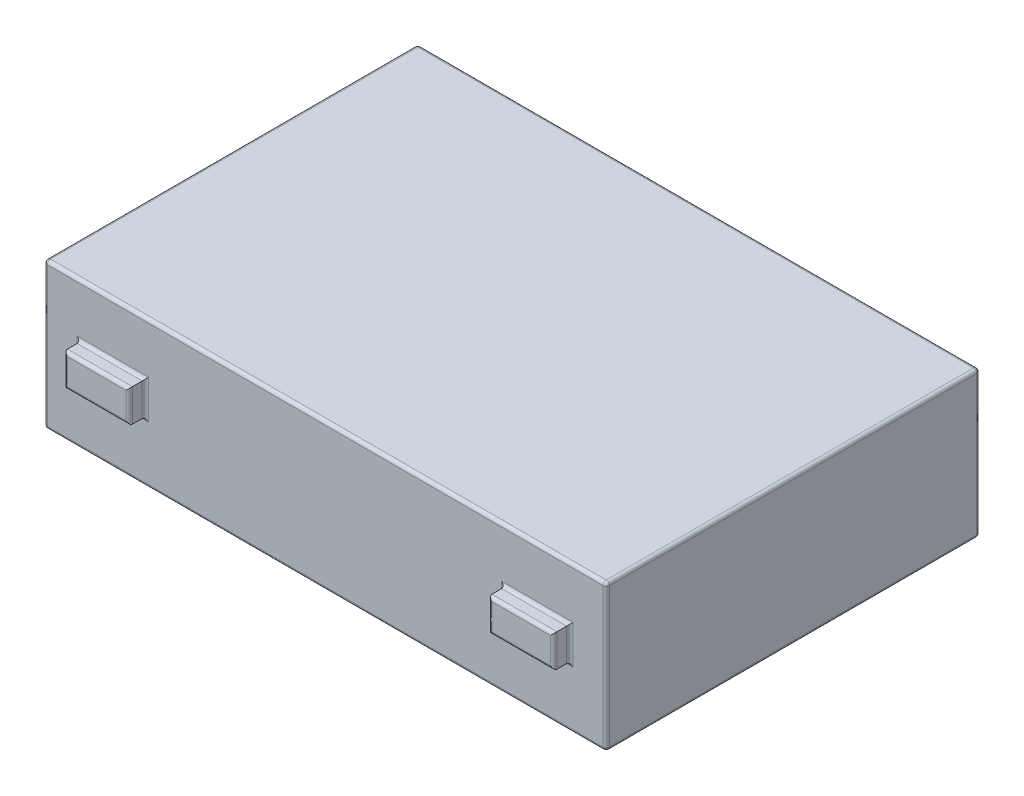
ISO-10303-21;
HEADER;
FILE_DESCRIPTION(('STEP AP214'),'2;1');
FILE_NAME('part.step','',(''),(''),'','','');
FILE_SCHEMA(('AUTOMOTIVE_DESIGN { 1 0 10303 214 1 1 1 1 }'));
ENDSEC;
DATA;
#1=APPLICATION_CONTEXT('core data for automotive mechanical design processes');
#2=APPLICATION_PROTOCOL_DEFINITION('international standard','automotive_design',2000,#1);
#3=PRODUCT_CONTEXT('',#1,'mechanical');
#4=PRODUCT('Part','Part','',(#3));
#5=PRODUCT_RELATED_PRODUCT_CATEGORY('part','',(#4));
#6=PRODUCT_DEFINITION_FORMATION('','',#4);
#7=PRODUCT_DEFINITION_CONTEXT('part definition',#1,'design');
#8=PRODUCT_DEFINITION('design','',#6,#7);
#9=PRODUCT_DEFINITION_SHAPE('','',#8);
#10=(LENGTH_UNIT() NAMED_UNIT(*) SI_UNIT(.MILLI.,.METRE.));
#11=(NAMED_UNIT(*) PLANE_ANGLE_UNIT() SI_UNIT($,.RADIAN.));
#12=(NAMED_UNIT(*) SI_UNIT($,.STERADIAN.) SOLID_ANGLE_UNIT());
#13=UNCERTAINTY_MEASURE_WITH_UNIT(LENGTH_MEASURE(1.E-05),#10,'distance_accuracy_value','');
#14=(GEOMETRIC_REPRESENTATION_CONTEXT(3) GLOBAL_UNCERTAINTY_ASSIGNED_CONTEXT((#13)) GLOBAL_UNIT_ASSIGNED_CONTEXT((#10,
#11,#12)) REPRESENTATION_CONTEXT('',''));
#15=CARTESIAN_POINT('',(0.,0.,0.));
#16=DIRECTION('',(0.,0.,1.));
#17=DIRECTION('',(1.,0.,0.));
#18=AXIS2_PLACEMENT_3D('',#15,#16,#17);
#19=CARTESIAN_POINT('',(0.,0.,115.));
#20=DIRECTION('',(0.,0.,1.));
#21=DIRECTION('',(1.,0.,0.));
#22=AXIS2_PLACEMENT_3D('',#19,#20,#21);
#23=PLANE('',#22);
#24=DIRECTION('',(1.,0.,0.));
#25=VECTOR('',#24,1.);
#26=CARTESIAN_POINT('',(0.,-4.88222245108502,115.));
#27=LINE('',#26,#25);
#28=CARTESIAN_POINT('',(76.318867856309,-4.88222245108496,115.));
#29=VERTEX_POINT('',#28);
#30=CARTESIAN_POINT('',(54.318867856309,-4.88222245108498,115.));
#31=VERTEX_POINT('',#30);
#32=EDGE_CURVE('E403',#29,#31,#27,.F.);
#33=ORIENTED_EDGE('',*,*,#32,.T.);
#34=DIRECTION('',(0.,-1.,0.));
#35=VECTOR('',#34,1.);
#36=CARTESIAN_POINT('',(54.318867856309,0.,115.));
#37=LINE('',#36,#35);
#38=CARTESIAN_POINT('',(54.318867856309,7.11777754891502,115.));
#39=VERTEX_POINT('',#38);
#40=EDGE_CURVE('E406',#31,#39,#37,.F.);
#41=ORIENTED_EDGE('',*,*,#40,.T.);
#42=DIRECTION('',(-1.,0.,0.));
#43=VECTOR('',#42,1.);
#44=CARTESIAN_POINT('',(0.,7.11777754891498,115.));
#45=LINE('',#44,#43);
#46=CARTESIAN_POINT('',(76.318867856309,7.11777754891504,115.));
#47=VERTEX_POINT('',#46);
#48=EDGE_CURVE('E397',#39,#47,#45,.F.);
#49=ORIENTED_EDGE('',*,*,#48,.T.);
#50=DIRECTION('',(0.,1.,0.));
#51=VECTOR('',#50,1.);
#52=CARTESIAN_POINT('',(76.318867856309,2.11827410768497E-13,115.));
#53=LINE('',#52,#51);
#54=EDGE_CURVE('E400',#47,#29,#53,.F.);
#55=ORIENTED_EDGE('',*,*,#54,.T.);
#56=EDGE_LOOP('',(#33,#41,#49,#55));
#57=FACE_BOUND('',#56,.T.);
#58=DIRECTION('',(-1.,0.,0.));
#59=VECTOR('',#58,1.);
#60=CARTESIAN_POINT('',(0.,7.11777754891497,115.));
#61=LINE('',#60,#59);
#62=CARTESIAN_POINT('',(-76.318867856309,7.11777754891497,115.));
#63=VERTEX_POINT('',#62);
#64=CARTESIAN_POINT('',(-54.318867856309,7.11777754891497,115.));
#65=VERTEX_POINT('',#64);
#66=EDGE_CURVE('E390',#63,#65,#61,.F.);
#67=ORIENTED_EDGE('',*,*,#66,.T.);
#68=DIRECTION('',(0.,1.,0.));
#69=VECTOR('',#68,1.);
#70=CARTESIAN_POINT('',(-54.318867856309,0.,115.));
#71=LINE('',#70,#69);
#72=CARTESIAN_POINT('',(-54.318867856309,-4.88222245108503,115.));
#73=VERTEX_POINT('',#72);
#74=EDGE_CURVE('E393',#65,#73,#71,.F.);
#75=ORIENTED_EDGE('',*,*,#74,.T.);
#76=DIRECTION('',(1.,0.,0.));
#77=VECTOR('',#76,1.);
#78=CARTESIAN_POINT('',(0.,-4.88222245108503,115.));
#79=LINE('',#78,#77);
#80=CARTESIAN_POINT('',(-76.318867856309,-4.88222245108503,115.));
#81=VERTEX_POINT('',#80);
#82=EDGE_CURVE('E384',#73,#81,#79,.F.);
#83=ORIENTED_EDGE('',*,*,#82,.T.);
#84=DIRECTION('',(0.,-1.,0.));
#85=VECTOR('',#84,1.);
#86=CARTESIAN_POINT('',(-76.318867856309,0.,115.));
#87=LINE('',#86,#85);
#88=EDGE_CURVE('E387',#81,#63,#87,.F.);
#89=ORIENTED_EDGE('',*,*,#88,.T.);
#90=EDGE_LOOP('',(#67,#75,#83,#89));
#91=FACE_BOUND('',#90,.T.);
#92=DIRECTION('',(0.,-1.,0.));
#93=VECTOR('',#92,1.);
#94=CARTESIAN_POINT('',(-85.5,-22.5,115.));
#95=LINE('',#94,#93);
#96=CARTESIAN_POINT('',(-85.5,21.5,115.));
#97=VERTEX_POINT('',#96);
#98=CARTESIAN_POINT('',(-85.5,-21.5,115.));
#99=VERTEX_POINT('',#98);
#100=EDGE_CURVE('E377',#97,#99,#95,.T.);
#101=ORIENTED_EDGE('',*,*,#100,.T.);
#102=DIRECTION('',(1.,0.,0.));
#103=VECTOR('',#102,1.);
#104=CARTESIAN_POINT('',(86.5,-21.5,115.));
#105=LINE('',#104,#103);
#106=CARTESIAN_POINT('',(85.5,-21.5,115.));
#107=VERTEX_POINT('',#106);
#108=EDGE_CURVE('E380',#99,#107,#105,.T.);
#109=ORIENTED_EDGE('',*,*,#108,.T.);
#110=DIRECTION('',(0.,1.,0.));
#111=VECTOR('',#110,1.);
#112=CARTESIAN_POINT('',(85.5,22.5,115.));
#113=LINE('',#112,#111);
#114=CARTESIAN_POINT('',(85.5,21.5,115.));
#115=VERTEX_POINT('',#114);
#116=EDGE_CURVE('E371',#107,#115,#113,.T.);
#117=ORIENTED_EDGE('',*,*,#116,.T.);
#118=DIRECTION('',(-1.,0.,0.));
#119=VECTOR('',#118,1.);
#120=CARTESIAN_POINT('',(-86.5,21.5,115.));
#121=LINE('',#120,#119);
#122=EDGE_CURVE('E374',#115,#97,#121,.T.);
#123=ORIENTED_EDGE('',*,*,#122,.T.);
#124=EDGE_LOOP('',(#101,#109,#117,#123));
#125=FACE_BOUND('',#124,.T.);
#126=ADVANCED_FACE('F49',(#57,#91,#125),#23,.T.);
#127=CARTESIAN_POINT('',(86.5,-22.5,115.));
#128=DIRECTION('',(-1.,0.,0.));
#129=DIRECTION('',(0.,-1.,0.));
#130=AXIS2_PLACEMENT_3D('',#127,#128,#129);
#131=PLANE('',#130);
#132=DIRECTION('',(0.,1.,0.));
#133=VECTOR('',#132,1.);
#134=CARTESIAN_POINT('',(86.5,-22.5,114.));
#135=LINE('',#134,#133);
#136=CARTESIAN_POINT('',(86.5,21.5,114.));
#137=VERTEX_POINT('',#136);
#138=CARTESIAN_POINT('',(86.5,-21.5,114.));
#139=VERTEX_POINT('',#138);
#140=EDGE_CURVE('E337',#137,#139,#135,.F.);
#141=ORIENTED_EDGE('',*,*,#140,.T.);
#142=DIRECTION('',(0.,0.,-1.));
#143=VECTOR('',#142,1.);
#144=CARTESIAN_POINT('',(86.5,-21.5,115.));
#145=LINE('',#144,#143);
#146=CARTESIAN_POINT('',(86.5,-21.5,1.));
#147=VERTEX_POINT('',#146);
#148=EDGE_CURVE('E346',#139,#147,#145,.T.);
#149=ORIENTED_EDGE('',*,*,#148,.T.);
#150=DIRECTION('',(0.,1.,0.));
#151=VECTOR('',#150,1.);
#152=CARTESIAN_POINT('',(86.5,-22.5,1.));
#153=LINE('',#152,#151);
#154=CARTESIAN_POINT('',(86.5,21.5,1.));
#155=VERTEX_POINT('',#154);
#156=EDGE_CURVE('E343',#147,#155,#153,.T.);
#157=ORIENTED_EDGE('',*,*,#156,.T.);
#158=DIRECTION('',(0.,0.,-1.));
#159=VECTOR('',#158,1.);
#160=CARTESIAN_POINT('',(86.5,21.5,115.));
#161=LINE('',#160,#159);
#162=EDGE_CURVE('E340',#155,#137,#161,.F.);
#163=ORIENTED_EDGE('',*,*,#162,.T.);
#164=EDGE_LOOP('',(#141,#149,#157,#163));
#165=FACE_BOUND('',#164,.T.);
#166=ADVANCED_FACE('F666',(#165),#131,.F.);
#167=CARTESIAN_POINT('',(86.5,22.5,115.));
#168=DIRECTION('',(0.,-1.,0.));
#169=DIRECTION('',(0.,0.,-1.));
#170=AXIS2_PLACEMENT_3D('',#167,#168,#169);
#171=PLANE('',#170);
#172=DIRECTION('',(0.,0.,-1.));
#173=VECTOR('',#172,1.);
#174=CARTESIAN_POINT('',(85.5,22.5,115.));
#175=LINE('',#174,#173);
#176=CARTESIAN_POINT('',(85.5,22.5,114.));
#177=VERTEX_POINT('',#176);
#178=CARTESIAN_POINT('',(85.5,22.5,1.));
#179=VERTEX_POINT('',#178);
#180=EDGE_CURVE('E356',#177,#179,#175,.T.);
#181=ORIENTED_EDGE('',*,*,#180,.T.);
#182=DIRECTION('',(-1.,0.,0.));
#183=VECTOR('',#182,1.);
#184=CARTESIAN_POINT('',(86.5,22.5,1.));
#185=LINE('',#184,#183);
#186=CARTESIAN_POINT('',(-85.5,22.5,1.));
#187=VERTEX_POINT('',#186);
#188=EDGE_CURVE('E360',#179,#187,#185,.T.);
#189=ORIENTED_EDGE('',*,*,#188,.T.);
#190=DIRECTION('',(0.,0.,-1.));
#191=VECTOR('',#190,1.);
#192=CARTESIAN_POINT('',(-85.5,22.5,115.));
#193=LINE('',#192,#191);
#194=CARTESIAN_POINT('',(-85.5,22.5,114.));
#195=VERTEX_POINT('',#194);
#196=EDGE_CURVE('E353',#187,#195,#193,.F.);
#197=ORIENTED_EDGE('',*,*,#196,.T.);
#198=DIRECTION('',(-1.,0.,0.));
#199=VECTOR('',#198,1.);
#200=CARTESIAN_POINT('',(86.5,22.5,114.));
#201=LINE('',#200,#199);
#202=EDGE_CURVE('E350',#195,#177,#201,.F.);
#203=ORIENTED_EDGE('',*,*,#202,.T.);
#204=EDGE_LOOP('',(#181,#189,#197,#203));
#205=FACE_BOUND('',#204,.T.);
#206=ADVANCED_FACE('F672',(#205),#171,.F.);
#207=CARTESIAN_POINT('',(-86.5,-22.5,115.));
#208=DIRECTION('',(1.,0.,0.));
#209=DIRECTION('',(0.,0.,-1.));
#210=AXIS2_PLACEMENT_3D('',#207,#208,#209);
#211=PLANE('',#210);
#212=DIRECTION('',(0.,0.,-1.));
#213=VECTOR('',#212,1.);
#214=CARTESIAN_POINT('',(-86.5,21.5,115.));
#215=LINE('',#214,#213);
#216=CARTESIAN_POINT('',(-86.5,21.5,114.));
#217=VERTEX_POINT('',#216);
#218=CARTESIAN_POINT('',(-86.5,21.5,1.));
#219=VERTEX_POINT('',#218);
#220=EDGE_CURVE('E301',#217,#219,#215,.T.);
#221=ORIENTED_EDGE('',*,*,#220,.T.);
#222=DIRECTION('',(0.,-1.,0.));
#223=VECTOR('',#222,1.);
#224=CARTESIAN_POINT('',(-86.5,-22.5,1.));
#225=LINE('',#224,#223);
#226=CARTESIAN_POINT('',(-86.5,-21.5,1.));
#227=VERTEX_POINT('',#226);
#228=EDGE_CURVE('E307',#219,#227,#225,.T.);
#229=ORIENTED_EDGE('',*,*,#228,.T.);
#230=DIRECTION('',(0.,0.,-1.));
#231=VECTOR('',#230,1.);
#232=CARTESIAN_POINT('',(-86.5,-21.5,115.));
#233=LINE('',#232,#231);
#234=CARTESIAN_POINT('',(-86.5,-21.5,114.));
#235=VERTEX_POINT('',#234);
#236=EDGE_CURVE('E304',#227,#235,#233,.F.);
#237=ORIENTED_EDGE('',*,*,#236,.T.);
#238=DIRECTION('',(0.,-1.,0.));
#239=VECTOR('',#238,1.);
#240=CARTESIAN_POINT('',(-86.5,22.5,114.));
#241=LINE('',#240,#239);
#242=EDGE_CURVE('E298',#235,#217,#241,.F.);
#243=ORIENTED_EDGE('',*,*,#242,.T.);
#244=EDGE_LOOP('',(#221,#229,#237,#243));
#245=FACE_BOUND('',#244,.T.);
#246=ADVANCED_FACE('F683',(#245),#211,.F.);
#247=CARTESIAN_POINT('',(86.5,-22.5,115.));
#248=DIRECTION('',(0.,1.,0.));
#249=DIRECTION('',(-1.,0.,0.));
#250=AXIS2_PLACEMENT_3D('',#247,#248,#249);
#251=PLANE('',#250);
#252=DIRECTION('',(1.,0.,0.));
#253=VECTOR('',#252,1.);
#254=CARTESIAN_POINT('',(-86.5,-22.5,114.));
#255=LINE('',#254,#253);
#256=CARTESIAN_POINT('',(85.5,-22.5,114.));
#257=VERTEX_POINT('',#256);
#258=CARTESIAN_POINT('',(-85.5,-22.5,114.));
#259=VERTEX_POINT('',#258);
#260=EDGE_CURVE('E324',#257,#259,#255,.F.);
#261=ORIENTED_EDGE('',*,*,#260,.T.);
#262=DIRECTION('',(0.,0.,-1.));
#263=VECTOR('',#262,1.);
#264=CARTESIAN_POINT('',(-85.5,-22.5,115.));
#265=LINE('',#264,#263);
#266=CARTESIAN_POINT('',(-85.5,-22.5,1.));
#267=VERTEX_POINT('',#266);
#268=EDGE_CURVE('E333',#259,#267,#265,.T.);
#269=ORIENTED_EDGE('',*,*,#268,.T.);
#270=DIRECTION('',(1.,0.,0.));
#271=VECTOR('',#270,1.);
#272=CARTESIAN_POINT('',(86.5,-22.5,1.));
#273=LINE('',#272,#271);
#274=CARTESIAN_POINT('',(85.5,-22.5,1.));
#275=VERTEX_POINT('',#274);
#276=EDGE_CURVE('E330',#267,#275,#273,.T.);
#277=ORIENTED_EDGE('',*,*,#276,.T.);
#278=DIRECTION('',(0.,0.,-1.));
#279=VECTOR('',#278,1.);
#280=CARTESIAN_POINT('',(85.5,-22.5,115.));
#281=LINE('',#280,#279);
#282=EDGE_CURVE('E327',#275,#257,#281,.F.);
#283=ORIENTED_EDGE('',*,*,#282,.T.);
#284=EDGE_LOOP('',(#261,#269,#277,#283));
#285=FACE_BOUND('',#284,.T.);
#286=ADVANCED_FACE('F679',(#285),#251,.F.);
#287=CARTESIAN_POINT('',(0.,0.,0.));
#288=DIRECTION('',(0.,0.,1.));
#289=DIRECTION('',(1.,0.,0.));
#290=AXIS2_PLACEMENT_3D('',#287,#288,#289);
#291=PLANE('',#290);
#292=DIRECTION('',(1.,0.,0.));
#293=VECTOR('',#292,1.);
#294=CARTESIAN_POINT('',(0.,-21.5,0.));
#295=LINE('',#294,#293);
#296=CARTESIAN_POINT('',(85.5,-21.5,0.));
#297=VERTEX_POINT('',#296);
#298=CARTESIAN_POINT('',(-85.5,-21.5,0.));
#299=VERTEX_POINT('',#298);
#300=EDGE_CURVE('E317',#297,#299,#295,.F.);
#301=ORIENTED_EDGE('',*,*,#300,.T.);
#302=DIRECTION('',(0.,-1.,0.));
#303=VECTOR('',#302,1.);
#304=CARTESIAN_POINT('',(-85.5,0.,0.));
#305=LINE('',#304,#303);
#306=CARTESIAN_POINT('',(-85.5,21.5,0.));
#307=VERTEX_POINT('',#306);
#308=EDGE_CURVE('E320',#299,#307,#305,.F.);
#309=ORIENTED_EDGE('',*,*,#308,.T.);
#310=DIRECTION('',(-1.,0.,0.));
#311=VECTOR('',#310,1.);
#312=CARTESIAN_POINT('',(0.,21.5,0.));
#313=LINE('',#312,#311);
#314=CARTESIAN_POINT('',(85.5,21.5,0.));
#315=VERTEX_POINT('',#314);
#316=EDGE_CURVE('E311',#307,#315,#313,.F.);
#317=ORIENTED_EDGE('',*,*,#316,.T.);
#318=DIRECTION('',(0.,1.,0.));
#319=VECTOR('',#318,1.);
#320=CARTESIAN_POINT('',(85.5,0.,0.));
#321=LINE('',#320,#319);
#322=EDGE_CURVE('E314',#315,#297,#321,.F.);
#323=ORIENTED_EDGE('',*,*,#322,.T.);
#324=EDGE_LOOP('',(#301,#309,#317,#323));
#325=FACE_BOUND('',#324,.T.);
#326=ADVANCED_FACE('F663',(#325),#291,.F.);
#327=CARTESIAN_POINT('',(-75.318867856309,6.11777754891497,120.));
#328=DIRECTION('',(1.,0.,0.));
#329=DIRECTION('',(0.,0.,-1.));
#330=AXIS2_PLACEMENT_3D('',#327,#328,#329);
#331=PLANE('',#330);
#332=DIRECTION('',(0.,0.,-1.));
#333=VECTOR('',#332,1.);
#334=CARTESIAN_POINT('',(-75.318867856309,-3.88222245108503,120.));
#335=LINE('',#334,#333);
#336=CARTESIAN_POINT('',(-75.318867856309,-3.88222245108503,119.));
#337=VERTEX_POINT('',#336);
#338=CARTESIAN_POINT('',(-75.318867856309,-3.88222245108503,116.));
#339=VERTEX_POINT('',#338);
#340=EDGE_CURVE('E262',#337,#339,#335,.T.);
#341=ORIENTED_EDGE('',*,*,#340,.F.);
#342=DIRECTION('',(0.,-1.,0.));
#343=VECTOR('',#342,1.);
#344=CARTESIAN_POINT('',(-75.318867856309,6.11777754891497,119.));
#345=LINE('',#344,#343);
#346=CARTESIAN_POINT('',(-75.318867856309,6.11777754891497,119.));
#347=VERTEX_POINT('',#346);
#348=EDGE_CURVE('E295',#337,#347,#345,.F.);
#349=ORIENTED_EDGE('',*,*,#348,.T.);
#350=DIRECTION('',(0.,0.,-1.));
#351=VECTOR('',#350,1.);
#352=CARTESIAN_POINT('',(-75.318867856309,6.11777754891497,120.));
#353=LINE('',#352,#351);
#354=CARTESIAN_POINT('',(-75.318867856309,6.11777754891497,116.));
#355=VERTEX_POINT('',#354);
#356=EDGE_CURVE('E595',#347,#355,#353,.T.);
#357=ORIENTED_EDGE('',*,*,#356,.T.);
#358=DIRECTION('',(0.,-1.,0.));
#359=VECTOR('',#358,1.);
#360=CARTESIAN_POINT('',(-75.318867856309,6.11777754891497,116.));
#361=LINE('',#360,#359);
#362=EDGE_CURVE('E292',#355,#339,#361,.T.);
#363=ORIENTED_EDGE('',*,*,#362,.T.);
#364=EDGE_LOOP('',(#341,#349,#357,#363));
#365=FACE_BOUND('',#364,.T.);
#366=ADVANCED_FACE('F646',(#365),#331,.F.);
#367=CARTESIAN_POINT('',(-75.318867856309,-3.88222245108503,120.));
#368=DIRECTION('',(0.,1.,0.));
#369=DIRECTION('',(0.,0.,1.));
#370=AXIS2_PLACEMENT_3D('',#367,#368,#369);
#371=PLANE('',#370);
#372=DIRECTION('',(0.,0.,-1.));
#373=VECTOR('',#372,1.);
#374=CARTESIAN_POINT('',(-55.318867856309,-3.88222245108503,120.));
#375=LINE('',#374,#373);
#376=CARTESIAN_POINT('',(-55.318867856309,-3.88222245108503,119.));
#377=VERTEX_POINT('',#376);
#378=CARTESIAN_POINT('',(-55.318867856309,-3.88222245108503,116.));
#379=VERTEX_POINT('',#378);
#380=EDGE_CURVE('E610',#377,#379,#375,.T.);
#381=ORIENTED_EDGE('',*,*,#380,.F.);
#382=DIRECTION('',(1.,0.,0.));
#383=VECTOR('',#382,1.);
#384=CARTESIAN_POINT('',(-75.318867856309,-3.88222245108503,119.));
#385=LINE('',#384,#383);
#386=EDGE_CURVE('E289',#377,#337,#385,.F.);
#387=ORIENTED_EDGE('',*,*,#386,.T.);
#388=ORIENTED_EDGE('',*,*,#340,.T.);
#389=DIRECTION('',(1.,0.,0.));
#390=VECTOR('',#389,1.);
#391=CARTESIAN_POINT('',(-75.318867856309,-3.88222245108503,116.));
#392=LINE('',#391,#390);
#393=EDGE_CURVE('E286',#339,#379,#392,.T.);
#394=ORIENTED_EDGE('',*,*,#393,.T.);
#395=EDGE_LOOP('',(#381,#387,#388,#394));
#396=FACE_BOUND('',#395,.T.);
#397=ADVANCED_FACE('F655',(#396),#371,.F.);
#398=CARTESIAN_POINT('',(-55.318867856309,6.11777754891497,120.));
#399=DIRECTION('',(-1.,0.,0.));
#400=DIRECTION('',(0.,0.,1.));
#401=AXIS2_PLACEMENT_3D('',#398,#399,#400);
#402=PLANE('',#401);
#403=DIRECTION('',(0.,0.,-1.));
#404=VECTOR('',#403,1.);
#405=CARTESIAN_POINT('',(-55.318867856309,6.11777754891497,120.));
#406=LINE('',#405,#404);
#407=CARTESIAN_POINT('',(-55.318867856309,6.11777754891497,119.));
#408=VERTEX_POINT('',#407);
#409=CARTESIAN_POINT('',(-55.318867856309,6.11777754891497,116.));
#410=VERTEX_POINT('',#409);
#411=EDGE_CURVE('E601',#408,#410,#406,.T.);
#412=ORIENTED_EDGE('',*,*,#411,.F.);
#413=DIRECTION('',(0.,1.,0.));
#414=VECTOR('',#413,1.);
#415=CARTESIAN_POINT('',(-55.318867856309,-3.88222245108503,119.));
#416=LINE('',#415,#414);
#417=EDGE_CURVE('E283',#408,#377,#416,.F.);
#418=ORIENTED_EDGE('',*,*,#417,.T.);
#419=ORIENTED_EDGE('',*,*,#380,.T.);
#420=DIRECTION('',(0.,1.,0.));
#421=VECTOR('',#420,1.);
#422=CARTESIAN_POINT('',(-55.318867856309,6.11777754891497,116.));
#423=LINE('',#422,#421);
#424=EDGE_CURVE('E279',#379,#410,#423,.T.);
#425=ORIENTED_EDGE('',*,*,#424,.T.);
#426=EDGE_LOOP('',(#412,#418,#419,#425));
#427=FACE_BOUND('',#426,.T.);
#428=ADVANCED_FACE('F630',(#427),#402,.F.);
#429=CARTESIAN_POINT('',(-75.318867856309,6.11777754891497,120.));
#430=DIRECTION('',(0.,-1.,0.));
#431=DIRECTION('',(0.,0.,-1.));
#432=AXIS2_PLACEMENT_3D('',#429,#430,#431);
#433=PLANE('',#432);
#434=ORIENTED_EDGE('',*,*,#356,.F.);
#435=DIRECTION('',(-1.,0.,0.));
#436=VECTOR('',#435,1.);
#437=CARTESIAN_POINT('',(-55.318867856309,6.11777754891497,119.));
#438=LINE('',#437,#436);
#439=EDGE_CURVE('E246',#347,#408,#438,.F.);
#440=ORIENTED_EDGE('',*,*,#439,.T.);
#441=ORIENTED_EDGE('',*,*,#411,.T.);
#442=DIRECTION('',(-1.,0.,0.));
#443=VECTOR('',#442,1.);
#444=CARTESIAN_POINT('',(-75.318867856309,6.11777754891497,116.));
#445=LINE('',#444,#443);
#446=EDGE_CURVE('E269',#410,#355,#445,.T.);
#447=ORIENTED_EDGE('',*,*,#446,.T.);
#448=EDGE_LOOP('',(#434,#440,#441,#447));
#449=FACE_BOUND('',#448,.T.);
#450=ADVANCED_FACE('F629',(#449),#433,.F.);
#451=CARTESIAN_POINT('',(0.,0.,120.));
#452=DIRECTION('',(0.,0.,1.));
#453=DIRECTION('',(1.,0.,0.));
#454=AXIS2_PLACEMENT_3D('',#451,#452,#453);
#455=PLANE('',#454);
#456=DIRECTION('',(0.,1.,0.));
#457=VECTOR('',#456,1.);
#458=CARTESIAN_POINT('',(-56.318867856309,6.11777754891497,120.));
#459=LINE('',#458,#457);
#460=CARTESIAN_POINT('',(-56.318867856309,-2.88222245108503,120.));
#461=VERTEX_POINT('',#460);
#462=CARTESIAN_POINT('',(-56.318867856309,5.11777754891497,120.));
#463=VERTEX_POINT('',#462);
#464=EDGE_CURVE('E266',#461,#463,#459,.T.);
#465=ORIENTED_EDGE('',*,*,#464,.T.);
#466=DIRECTION('',(-1.,0.,0.));
#467=VECTOR('',#466,1.);
#468=CARTESIAN_POINT('',(-75.318867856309,5.11777754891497,120.));
#469=LINE('',#468,#467);
#470=CARTESIAN_POINT('',(-74.318867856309,5.11777754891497,120.));
#471=VERTEX_POINT('',#470);
#472=EDGE_CURVE('E244',#463,#471,#469,.T.);
#473=ORIENTED_EDGE('',*,*,#472,.T.);
#474=DIRECTION('',(0.,-1.,0.));
#475=VECTOR('',#474,1.);
#476=CARTESIAN_POINT('',(-74.318867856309,-3.88222245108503,120.));
#477=LINE('',#476,#475);
#478=CARTESIAN_POINT('',(-74.318867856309,-2.88222245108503,120.));
#479=VERTEX_POINT('',#478);
#480=EDGE_CURVE('E254',#471,#479,#477,.T.);
#481=ORIENTED_EDGE('',*,*,#480,.T.);
#482=DIRECTION('',(1.,0.,0.));
#483=VECTOR('',#482,1.);
#484=CARTESIAN_POINT('',(-55.318867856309,-2.88222245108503,120.));
#485=LINE('',#484,#483);
#486=EDGE_CURVE('E261',#479,#461,#485,.T.);
#487=ORIENTED_EDGE('',*,*,#486,.T.);
#488=EDGE_LOOP('',(#465,#473,#481,#487));
#489=FACE_BOUND('',#488,.T.);
#490=ADVANCED_FACE('F264',(#489),#455,.T.);
#491=CARTESIAN_POINT('',(75.318867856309,6.11777754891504,120.));
#492=DIRECTION('',(-1.,0.,0.));
#493=DIRECTION('',(0.,-1.,0.));
#494=AXIS2_PLACEMENT_3D('',#491,#492,#493);
#495=PLANE('',#494);
#496=DIRECTION('',(0.,0.,-1.));
#497=VECTOR('',#496,1.);
#498=CARTESIAN_POINT('',(75.318867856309,-3.88222245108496,120.));
#499=LINE('',#498,#497);
#500=CARTESIAN_POINT('',(75.318867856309,-3.88222245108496,119.));
#501=VERTEX_POINT('',#500);
#502=CARTESIAN_POINT('',(75.318867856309,-3.88222245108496,116.));
#503=VERTEX_POINT('',#502);
#504=EDGE_CURVE('E586',#501,#503,#499,.T.);
#505=ORIENTED_EDGE('',*,*,#504,.T.);
#506=DIRECTION('',(0.,1.,0.));
#507=VECTOR('',#506,1.);
#508=CARTESIAN_POINT('',(75.318867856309,6.11777754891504,116.));
#509=LINE('',#508,#507);
#510=CARTESIAN_POINT('',(75.318867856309,6.11777754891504,116.));
#511=VERTEX_POINT('',#510);
#512=EDGE_CURVE('E419',#503,#511,#509,.T.);
#513=ORIENTED_EDGE('',*,*,#512,.T.);
#514=DIRECTION('',(0.,0.,-1.));
#515=VECTOR('',#514,1.);
#516=CARTESIAN_POINT('',(75.318867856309,6.11777754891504,120.));
#517=LINE('',#516,#515);
#518=CARTESIAN_POINT('',(75.318867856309,6.11777754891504,119.));
#519=VERTEX_POINT('',#518);
#520=EDGE_CURVE('E443',#519,#511,#517,.T.);
#521=ORIENTED_EDGE('',*,*,#520,.F.);
#522=DIRECTION('',(0.,1.,0.));
#523=VECTOR('',#522,1.);
#524=CARTESIAN_POINT('',(75.318867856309,6.11777754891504,119.));
#525=LINE('',#524,#523);
#526=EDGE_CURVE('E416',#519,#501,#525,.F.);
#527=ORIENTED_EDGE('',*,*,#526,.T.);
#528=EDGE_LOOP('',(#505,#513,#521,#527));
#529=FACE_BOUND('',#528,.T.);
#530=ADVANCED_FACE('F585',(#529),#495,.F.);
#531=CARTESIAN_POINT('',(75.318867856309,6.11777754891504,120.));
#532=DIRECTION('',(0.,-1.,0.));
#533=DIRECTION('',(1.,0.,0.));
#534=AXIS2_PLACEMENT_3D('',#531,#532,#533);
#535=PLANE('',#534);
#536=ORIENTED_EDGE('',*,*,#520,.T.);
#537=DIRECTION('',(-1.,0.,0.));
#538=VECTOR('',#537,1.);
#539=CARTESIAN_POINT('',(75.318867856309,6.11777754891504,116.));
#540=LINE('',#539,#538);
#541=CARTESIAN_POINT('',(55.318867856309,6.11777754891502,116.));
#542=VERTEX_POINT('',#541);
#543=EDGE_CURVE('E425',#511,#542,#540,.T.);
#544=ORIENTED_EDGE('',*,*,#543,.T.);
#545=DIRECTION('',(0.,0.,-1.));
#546=VECTOR('',#545,1.);
#547=CARTESIAN_POINT('',(55.318867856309,6.11777754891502,120.));
#548=LINE('',#547,#546);
#549=CARTESIAN_POINT('',(55.318867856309,6.11777754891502,119.));
#550=VERTEX_POINT('',#549);
#551=EDGE_CURVE('E603',#550,#542,#548,.T.);
#552=ORIENTED_EDGE('',*,*,#551,.F.);
#553=DIRECTION('',(-1.,0.,0.));
#554=VECTOR('',#553,1.);
#555=CARTESIAN_POINT('',(75.318867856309,6.11777754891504,119.));
#556=LINE('',#555,#554);
#557=EDGE_CURVE('E422',#550,#519,#556,.F.);
#558=ORIENTED_EDGE('',*,*,#557,.T.);
#559=EDGE_LOOP('',(#536,#544,#552,#558));
#560=FACE_BOUND('',#559,.T.);
#561=ADVANCED_FACE('F1018',(#560),#535,.F.);
#562=CARTESIAN_POINT('',(55.318867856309,6.11777754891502,120.));
#563=DIRECTION('',(1.,0.,0.));
#564=DIRECTION('',(0.,0.,-1.));
#565=AXIS2_PLACEMENT_3D('',#562,#563,#564);
#566=PLANE('',#565);
#567=ORIENTED_EDGE('',*,*,#551,.T.);
#568=DIRECTION('',(0.,-1.,0.));
#569=VECTOR('',#568,1.);
#570=CARTESIAN_POINT('',(55.318867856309,6.11777754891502,116.));
#571=LINE('',#570,#569);
#572=CARTESIAN_POINT('',(55.318867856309,-3.88222245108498,116.));
#573=VERTEX_POINT('',#572);
#574=EDGE_CURVE('E367',#542,#573,#571,.T.);
#575=ORIENTED_EDGE('',*,*,#574,.T.);
#576=DIRECTION('',(0.,0.,-1.));
#577=VECTOR('',#576,1.);
#578=CARTESIAN_POINT('',(55.318867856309,-3.88222245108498,120.));
#579=LINE('',#578,#577);
#580=CARTESIAN_POINT('',(55.318867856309,-3.88222245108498,119.));
#581=VERTEX_POINT('',#580);
#582=EDGE_CURVE('E596',#581,#573,#579,.T.);
#583=ORIENTED_EDGE('',*,*,#582,.F.);
#584=DIRECTION('',(0.,-1.,0.));
#585=VECTOR('',#584,1.);
#586=CARTESIAN_POINT('',(55.318867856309,6.11777754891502,119.));
#587=LINE('',#586,#585);
#588=EDGE_CURVE('E363',#581,#550,#587,.F.);
#589=ORIENTED_EDGE('',*,*,#588,.T.);
#590=EDGE_LOOP('',(#567,#575,#583,#589));
#591=FACE_BOUND('',#590,.T.);
#592=ADVANCED_FACE('F1027',(#591),#566,.F.);
#593=CARTESIAN_POINT('',(75.318867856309,-3.88222245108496,120.));
#594=DIRECTION('',(0.,1.,0.));
#595=DIRECTION('',(-1.,0.,0.));
#596=AXIS2_PLACEMENT_3D('',#593,#594,#595);
#597=PLANE('',#596);
#598=ORIENTED_EDGE('',*,*,#582,.T.);
#599=DIRECTION('',(1.,0.,0.));
#600=VECTOR('',#599,1.);
#601=CARTESIAN_POINT('',(75.318867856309,-3.88222245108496,116.));
#602=LINE('',#601,#600);
#603=EDGE_CURVE('E413',#573,#503,#602,.T.);
#604=ORIENTED_EDGE('',*,*,#603,.T.);
#605=ORIENTED_EDGE('',*,*,#504,.F.);
#606=DIRECTION('',(1.,0.,0.));
#607=VECTOR('',#606,1.);
#608=CARTESIAN_POINT('',(75.318867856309,-3.88222245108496,119.));
#609=LINE('',#608,#607);
#610=EDGE_CURVE('E410',#501,#581,#609,.F.);
#611=ORIENTED_EDGE('',*,*,#610,.T.);
#612=EDGE_LOOP('',(#598,#604,#605,#611));
#613=FACE_BOUND('',#612,.T.);
#614=ADVANCED_FACE('F591',(#613),#597,.F.);
#615=CARTESIAN_POINT('',(0.,0.,120.));
#616=DIRECTION('',(0.,0.,-1.));
#617=DIRECTION('',(-1.,0.,0.));
#618=AXIS2_PLACEMENT_3D('',#615,#616,#617);
#619=PLANE('',#618);
#620=DIRECTION('',(-1.,0.,0.));
#621=VECTOR('',#620,1.);
#622=CARTESIAN_POINT('',(0.,5.11777754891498,120.));
#623=LINE('',#622,#621);
#624=CARTESIAN_POINT('',(74.318867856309,5.11777754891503,120.));
#625=VERTEX_POINT('',#624);
#626=CARTESIAN_POINT('',(56.318867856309,5.11777754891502,120.));
#627=VERTEX_POINT('',#626);
#628=EDGE_CURVE('E74',#625,#627,#623,.T.);
#629=ORIENTED_EDGE('',*,*,#628,.T.);
#630=DIRECTION('',(0.,-1.,0.));
#631=VECTOR('',#630,1.);
#632=CARTESIAN_POINT('',(56.318867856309,0.,120.));
#633=LINE('',#632,#631);
#634=CARTESIAN_POINT('',(56.318867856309,-2.88222245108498,120.));
#635=VERTEX_POINT('',#634);
#636=EDGE_CURVE('E11',#627,#635,#633,.T.);
#637=ORIENTED_EDGE('',*,*,#636,.T.);
#638=DIRECTION('',(1.,0.,0.));
#639=VECTOR('',#638,1.);
#640=CARTESIAN_POINT('',(0.,-2.88222245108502,120.));
#641=LINE('',#640,#639);
#642=CARTESIAN_POINT('',(74.318867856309,-2.88222245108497,120.));
#643=VERTEX_POINT('',#642);
#644=EDGE_CURVE('E59',#635,#643,#641,.T.);
#645=ORIENTED_EDGE('',*,*,#644,.T.);
#646=DIRECTION('',(0.,1.,0.));
#647=VECTOR('',#646,1.);
#648=CARTESIAN_POINT('',(74.318867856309,2.06276295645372E-13,120.));
#649=LINE('',#648,#647);
#650=EDGE_CURVE('E428',#643,#625,#649,.T.);
#651=ORIENTED_EDGE('',*,*,#650,.T.);
#652=EDGE_LOOP('',(#629,#637,#645,#651));
#653=FACE_BOUND('',#652,.T.);
#654=ADVANCED_FACE('F700',(#653),#619,.F.);
#655=CARTESIAN_POINT('',(0.,-2.88222245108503,119.));
#656=DIRECTION('',(-1.,0.,0.));
#657=DIRECTION('',(0.,0.,1.));
#658=AXIS2_PLACEMENT_3D('',#655,#656,#657);
#659=CYLINDRICAL_SURFACE('',#658,1.);
#660=CARTESIAN_POINT('',(-74.318867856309,-2.88222245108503,119.));
#661=DIRECTION('',(-0.707106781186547,0.707106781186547,0.));
#662=DIRECTION('',(0.707106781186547,0.707106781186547,0.));
#663=AXIS2_PLACEMENT_3D('',#660,#661,#662);
#664=ELLIPSE('',#663,1.41421356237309,1.);
#665=EDGE_CURVE('E257',#337,#479,#664,.T.);
#666=ORIENTED_EDGE('',*,*,#665,.F.);
#667=ORIENTED_EDGE('',*,*,#386,.F.);
#668=CARTESIAN_POINT('',(-56.318867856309,-2.88222245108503,119.));
#669=DIRECTION('',(-0.707106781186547,-0.707106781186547,0.));
#670=DIRECTION('',(-0.707106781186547,0.707106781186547,0.));
#671=AXIS2_PLACEMENT_3D('',#668,#669,#670);
#672=ELLIPSE('',#671,1.41421356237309,1.);
#673=EDGE_CURVE('E439',#461,#377,#672,.F.);
#674=ORIENTED_EDGE('',*,*,#673,.F.);
#675=ORIENTED_EDGE('',*,*,#486,.F.);
#676=EDGE_LOOP('',(#666,#667,#674,#675));
#677=FACE_BOUND('',#676,.T.);
#678=ADVANCED_FACE('F620',(#677),#659,.T.);
#679=CARTESIAN_POINT('',(-56.318867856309,0.,119.));
#680=DIRECTION('',(0.,-1.,0.));
#681=DIRECTION('',(0.,0.,-1.));
#682=AXIS2_PLACEMENT_3D('',#679,#680,#681);
#683=CYLINDRICAL_SURFACE('',#682,1.);
#684=ORIENTED_EDGE('',*,*,#673,.T.);
#685=ORIENTED_EDGE('',*,*,#417,.F.);
#686=CARTESIAN_POINT('',(-56.318867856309,5.11777754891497,119.));
#687=DIRECTION('',(0.707106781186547,-0.707106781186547,0.));
#688=DIRECTION('',(-0.707106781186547,-0.707106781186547,0.));
#689=AXIS2_PLACEMENT_3D('',#686,#687,#688);
#690=ELLIPSE('',#689,1.41421356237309,1.);
#691=EDGE_CURVE('E250',#463,#408,#690,.F.);
#692=ORIENTED_EDGE('',*,*,#691,.F.);
#693=ORIENTED_EDGE('',*,*,#464,.F.);
#694=EDGE_LOOP('',(#684,#685,#692,#693));
#695=FACE_BOUND('',#694,.T.);
#696=ADVANCED_FACE('F623',(#695),#683,.T.);
#697=CARTESIAN_POINT('',(-74.318867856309,0.,119.));
#698=DIRECTION('',(0.,1.,0.));
#699=DIRECTION('',(0.,0.,1.));
#700=AXIS2_PLACEMENT_3D('',#697,#698,#699);
#701=CYLINDRICAL_SURFACE('',#700,1.);
#702=ORIENTED_EDGE('',*,*,#665,.T.);
#703=ORIENTED_EDGE('',*,*,#480,.F.);
#704=CARTESIAN_POINT('',(-74.318867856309,5.11777754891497,119.));
#705=DIRECTION('',(0.707106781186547,0.707106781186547,0.));
#706=DIRECTION('',(-0.707106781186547,0.707106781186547,0.));
#707=AXIS2_PLACEMENT_3D('',#704,#705,#706);
#708=ELLIPSE('',#707,1.41421356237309,1.);
#709=EDGE_CURVE('E240',#347,#471,#708,.T.);
#710=ORIENTED_EDGE('',*,*,#709,.F.);
#711=ORIENTED_EDGE('',*,*,#348,.F.);
#712=EDGE_LOOP('',(#702,#703,#710,#711));
#713=FACE_BOUND('',#712,.T.);
#714=ADVANCED_FACE('F255',(#713),#701,.T.);
#715=CARTESIAN_POINT('',(0.,5.11777754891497,119.));
#716=DIRECTION('',(1.,0.,0.));
#717=DIRECTION('',(0.,0.,-1.));
#718=AXIS2_PLACEMENT_3D('',#715,#716,#717);
#719=CYLINDRICAL_SURFACE('',#718,1.);
#720=ORIENTED_EDGE('',*,*,#691,.T.);
#721=ORIENTED_EDGE('',*,*,#439,.F.);
#722=ORIENTED_EDGE('',*,*,#709,.T.);
#723=ORIENTED_EDGE('',*,*,#472,.F.);
#724=EDGE_LOOP('',(#720,#721,#722,#723));
#725=FACE_BOUND('',#724,.T.);
#726=ADVANCED_FACE('F242',(#725),#719,.T.);
#727=CARTESIAN_POINT('',(85.5,0.,114.));
#728=DIRECTION('',(0.,-1.,0.));
#729=DIRECTION('',(1.,0.,0.));
#730=AXIS2_PLACEMENT_3D('',#727,#728,#729);
#731=CYLINDRICAL_SURFACE('',#730,1.);
#732=CARTESIAN_POINT('',(85.5,21.5,114.));
#733=DIRECTION('',(0.,1.,0.));
#734=DIRECTION('',(0.,0.,1.));
#735=AXIS2_PLACEMENT_3D('',#732,#733,#734);
#736=CIRCLE('',#735,1.);
#737=EDGE_CURVE('E251',#115,#137,#736,.T.);
#738=ORIENTED_EDGE('',*,*,#737,.F.);
#739=ORIENTED_EDGE('',*,*,#116,.F.);
#740=CARTESIAN_POINT('',(85.5,-21.5,114.));
#741=DIRECTION('',(0.,-1.,0.));
#742=DIRECTION('',(0.,0.,-1.));
#743=AXIS2_PLACEMENT_3D('',#740,#741,#742);
#744=CIRCLE('',#743,1.);
#745=EDGE_CURVE('E528',#139,#107,#744,.T.);
#746=ORIENTED_EDGE('',*,*,#745,.F.);
#747=ORIENTED_EDGE('',*,*,#140,.F.);
#748=EDGE_LOOP('',(#738,#739,#746,#747));
#749=FACE_BOUND('',#748,.T.);
#750=ADVANCED_FACE('F693',(#749),#731,.T.);
#751=CARTESIAN_POINT('',(85.5,21.5,114.));
#752=DIRECTION('',(1.,0.,0.));
#753=DIRECTION('',(0.,0.,-1.));
#754=AXIS2_PLACEMENT_3D('',#751,#752,#753);
#755=SPHERICAL_SURFACE('',#754,1.);
#756=CARTESIAN_POINT('',(85.5,21.5,114.));
#757=DIRECTION('',(1.,0.,0.));
#758=DIRECTION('',(0.,0.,-1.));
#759=AXIS2_PLACEMENT_3D('',#756,#757,#758);
#760=CIRCLE('',#759,1.);
#761=EDGE_CURVE('E520',#115,#177,#760,.F.);
#762=ORIENTED_EDGE('',*,*,#761,.F.);
#763=ORIENTED_EDGE('',*,*,#737,.T.);
#764=CARTESIAN_POINT('',(85.5,21.5,114.));
#765=DIRECTION('',(0.,0.,1.));
#766=DIRECTION('',(1.,0.,0.));
#767=AXIS2_PLACEMENT_3D('',#764,#765,#766);
#768=CIRCLE('',#767,1.);
#769=EDGE_CURVE('E524',#177,#137,#768,.F.);
#770=ORIENTED_EDGE('',*,*,#769,.F.);
#771=EDGE_LOOP('',(#762,#763,#770));
#772=FACE_BOUND('',#771,.T.);
#773=ADVANCED_FACE('F773',(#772),#755,.T.);
#774=CARTESIAN_POINT('',(85.5,-21.5,114.));
#775=DIRECTION('',(0.,0.,1.));
#776=DIRECTION('',(1.,0.,0.));
#777=AXIS2_PLACEMENT_3D('',#774,#775,#776);
#778=SPHERICAL_SURFACE('',#777,1.);
#779=CARTESIAN_POINT('',(85.5,-21.5,114.));
#780=DIRECTION('',(0.,0.,1.));
#781=DIRECTION('',(1.,0.,0.));
#782=AXIS2_PLACEMENT_3D('',#779,#780,#781);
#783=CIRCLE('',#782,1.);
#784=EDGE_CURVE('E513',#139,#257,#783,.F.);
#785=ORIENTED_EDGE('',*,*,#784,.F.);
#786=ORIENTED_EDGE('',*,*,#745,.T.);
#787=CARTESIAN_POINT('',(85.5,-21.5,114.));
#788=DIRECTION('',(1.,0.,0.));
#789=DIRECTION('',(0.,0.,-1.));
#790=AXIS2_PLACEMENT_3D('',#787,#788,#789);
#791=CIRCLE('',#790,1.);
#792=EDGE_CURVE('E517',#257,#107,#791,.F.);
#793=ORIENTED_EDGE('',*,*,#792,.F.);
#794=EDGE_LOOP('',(#785,#786,#793));
#795=FACE_BOUND('',#794,.T.);
#796=ADVANCED_FACE('F769',(#795),#778,.T.);
#797=CARTESIAN_POINT('',(85.5,21.5,115.));
#798=DIRECTION('',(0.,0.,-1.));
#799=DIRECTION('',(-1.,0.,0.));
#800=AXIS2_PLACEMENT_3D('',#797,#798,#799);
#801=CYLINDRICAL_SURFACE('',#800,1.);
#802=ORIENTED_EDGE('',*,*,#769,.T.);
#803=ORIENTED_EDGE('',*,*,#162,.F.);
#804=CARTESIAN_POINT('',(85.5,21.5,1.));
#805=DIRECTION('',(0.,0.,-1.));
#806=DIRECTION('',(-1.,0.,0.));
#807=AXIS2_PLACEMENT_3D('',#804,#805,#806);
#808=CIRCLE('',#807,1.);
#809=EDGE_CURVE('E505',#179,#155,#808,.T.);
#810=ORIENTED_EDGE('',*,*,#809,.F.);
#811=ORIENTED_EDGE('',*,*,#180,.F.);
#812=EDGE_LOOP('',(#802,#803,#810,#811));
#813=FACE_BOUND('',#812,.T.);
#814=ADVANCED_FACE('F765',(#813),#801,.T.);
#815=CARTESIAN_POINT('',(0.,21.5,114.));
#816=DIRECTION('',(1.,0.,0.));
#817=DIRECTION('',(0.,0.,-1.));
#818=AXIS2_PLACEMENT_3D('',#815,#816,#817);
#819=CYLINDRICAL_SURFACE('',#818,1.);
#820=ORIENTED_EDGE('',*,*,#761,.T.);
#821=ORIENTED_EDGE('',*,*,#202,.F.);
#822=CARTESIAN_POINT('',(-85.5,21.5,114.));
#823=DIRECTION('',(-1.,0.,0.));
#824=DIRECTION('',(0.,0.,1.));
#825=AXIS2_PLACEMENT_3D('',#822,#823,#824);
#826=CIRCLE('',#825,1.);
#827=EDGE_CURVE('E501',#97,#195,#826,.T.);
#828=ORIENTED_EDGE('',*,*,#827,.F.);
#829=ORIENTED_EDGE('',*,*,#122,.F.);
#830=EDGE_LOOP('',(#820,#821,#828,#829));
#831=FACE_BOUND('',#830,.T.);
#832=ADVANCED_FACE('F761',(#831),#819,.T.);
#833=CARTESIAN_POINT('',(-85.5,0.,114.));
#834=DIRECTION('',(0.,1.,0.));
#835=DIRECTION('',(0.,0.,1.));
#836=AXIS2_PLACEMENT_3D('',#833,#834,#835);
#837=CYLINDRICAL_SURFACE('',#836,1.);
#838=CARTESIAN_POINT('',(-85.5,-21.5,114.));
#839=DIRECTION('',(0.,-1.,0.));
#840=DIRECTION('',(0.,0.,-1.));
#841=AXIS2_PLACEMENT_3D('',#838,#839,#840);
#842=CIRCLE('',#841,1.);
#843=EDGE_CURVE('E493',#99,#235,#842,.T.);
#844=ORIENTED_EDGE('',*,*,#843,.F.);
#845=ORIENTED_EDGE('',*,*,#100,.F.);
#846=CARTESIAN_POINT('',(-85.5,21.5,114.));
#847=DIRECTION('',(0.,1.,0.));
#848=DIRECTION('',(0.,0.,1.));
#849=AXIS2_PLACEMENT_3D('',#846,#847,#848);
#850=CIRCLE('',#849,1.);
#851=EDGE_CURVE('E497',#217,#97,#850,.T.);
#852=ORIENTED_EDGE('',*,*,#851,.F.);
#853=ORIENTED_EDGE('',*,*,#242,.F.);
#854=EDGE_LOOP('',(#844,#845,#852,#853));
#855=FACE_BOUND('',#854,.T.);
#856=ADVANCED_FACE('F757',(#855),#837,.T.);
#857=CARTESIAN_POINT('',(0.,-21.5,114.));
#858=DIRECTION('',(-1.,0.,0.));
#859=DIRECTION('',(0.,-1.,0.));
#860=AXIS2_PLACEMENT_3D('',#857,#858,#859);
#861=CYLINDRICAL_SURFACE('',#860,1.);
#862=ORIENTED_EDGE('',*,*,#792,.T.);
#863=ORIENTED_EDGE('',*,*,#108,.F.);
#864=CARTESIAN_POINT('',(-85.5,-21.5,114.));
#865=DIRECTION('',(-1.,0.,0.));
#866=DIRECTION('',(0.,0.,1.));
#867=AXIS2_PLACEMENT_3D('',#864,#865,#866);
#868=CIRCLE('',#867,1.);
#869=EDGE_CURVE('E489',#259,#99,#868,.T.);
#870=ORIENTED_EDGE('',*,*,#869,.F.);
#871=ORIENTED_EDGE('',*,*,#260,.F.);
#872=EDGE_LOOP('',(#862,#863,#870,#871));
#873=FACE_BOUND('',#872,.T.);
#874=ADVANCED_FACE('F753',(#873),#861,.T.);
#875=CARTESIAN_POINT('',(85.5,-21.5,115.));
#876=DIRECTION('',(0.,0.,-1.));
#877=DIRECTION('',(-1.,0.,0.));
#878=AXIS2_PLACEMENT_3D('',#875,#876,#877);
#879=CYLINDRICAL_SURFACE('',#878,1.);
#880=ORIENTED_EDGE('',*,*,#784,.T.);
#881=ORIENTED_EDGE('',*,*,#282,.F.);
#882=CARTESIAN_POINT('',(85.5,-21.5,1.));
#883=DIRECTION('',(0.,0.,-1.));
#884=DIRECTION('',(-1.,0.,0.));
#885=AXIS2_PLACEMENT_3D('',#882,#883,#884);
#886=CIRCLE('',#885,1.);
#887=EDGE_CURVE('E485',#147,#275,#886,.T.);
#888=ORIENTED_EDGE('',*,*,#887,.F.);
#889=ORIENTED_EDGE('',*,*,#148,.F.);
#890=EDGE_LOOP('',(#880,#881,#888,#889));
#891=FACE_BOUND('',#890,.T.);
#892=ADVANCED_FACE('F749',(#891),#879,.T.);
#893=CARTESIAN_POINT('',(85.5,-22.5,1.));
#894=DIRECTION('',(0.,1.,0.));
#895=DIRECTION('',(-1.,0.,0.));
#896=AXIS2_PLACEMENT_3D('',#893,#894,#895);
#897=CYLINDRICAL_SURFACE('',#896,1.);
#898=CARTESIAN_POINT('',(85.5,21.5,1.));
#899=DIRECTION('',(0.,1.,0.));
#900=DIRECTION('',(0.,0.,1.));
#901=AXIS2_PLACEMENT_3D('',#898,#899,#900);
#902=CIRCLE('',#901,1.);
#903=EDGE_CURVE('E509',#155,#315,#902,.T.);
#904=ORIENTED_EDGE('',*,*,#903,.F.);
#905=ORIENTED_EDGE('',*,*,#156,.F.);
#906=CARTESIAN_POINT('',(85.5,-21.5,1.));
#907=DIRECTION('',(0.,-1.,0.));
#908=DIRECTION('',(0.,0.,-1.));
#909=AXIS2_PLACEMENT_3D('',#906,#907,#908);
#910=CIRCLE('',#909,1.);
#911=EDGE_CURVE('E482',#297,#147,#910,.T.);
#912=ORIENTED_EDGE('',*,*,#911,.F.);
#913=ORIENTED_EDGE('',*,*,#322,.F.);
#914=EDGE_LOOP('',(#904,#905,#912,#913));
#915=FACE_BOUND('',#914,.T.);
#916=ADVANCED_FACE('F745',(#915),#897,.T.);
#917=CARTESIAN_POINT('',(85.5,21.5,1.));
#918=DIRECTION('',(1.,0.,0.));
#919=DIRECTION('',(0.,0.,-1.));
#920=AXIS2_PLACEMENT_3D('',#917,#918,#919);
#921=SPHERICAL_SURFACE('',#920,1.);
#922=ORIENTED_EDGE('',*,*,#809,.T.);
#923=ORIENTED_EDGE('',*,*,#903,.T.);
#924=CARTESIAN_POINT('',(85.5,21.5,1.));
#925=DIRECTION('',(1.,0.,0.));
#926=DIRECTION('',(0.,0.,-1.));
#927=AXIS2_PLACEMENT_3D('',#924,#925,#926);
#928=CIRCLE('',#927,1.);
#929=EDGE_CURVE('E478',#179,#315,#928,.F.);
#930=ORIENTED_EDGE('',*,*,#929,.F.);
#931=EDGE_LOOP('',(#922,#923,#930));
#932=FACE_BOUND('',#931,.T.);
#933=ADVANCED_FACE('F741',(#932),#921,.T.);
#934=CARTESIAN_POINT('',(-85.5,21.5,114.));
#935=DIRECTION('',(0.,0.,1.));
#936=DIRECTION('',(1.,0.,0.));
#937=AXIS2_PLACEMENT_3D('',#934,#935,#936);
#938=SPHERICAL_SURFACE('',#937,1.);
#939=ORIENTED_EDGE('',*,*,#851,.T.);
#940=ORIENTED_EDGE('',*,*,#827,.T.);
#941=CARTESIAN_POINT('',(-85.5,21.5,114.));
#942=DIRECTION('',(0.,0.,1.));
#943=DIRECTION('',(1.,0.,0.));
#944=AXIS2_PLACEMENT_3D('',#941,#942,#943);
#945=CIRCLE('',#944,1.);
#946=EDGE_CURVE('E474',#217,#195,#945,.F.);
#947=ORIENTED_EDGE('',*,*,#946,.F.);
#948=EDGE_LOOP('',(#939,#940,#947));
#949=FACE_BOUND('',#948,.T.);
#950=ADVANCED_FACE('F737',(#949),#938,.T.);
#951=CARTESIAN_POINT('',(-85.5,-21.5,114.));
#952=DIRECTION('',(0.,0.,1.));
#953=DIRECTION('',(1.,0.,0.));
#954=AXIS2_PLACEMENT_3D('',#951,#952,#953);
#955=SPHERICAL_SURFACE('',#954,1.);
#956=ORIENTED_EDGE('',*,*,#869,.T.);
#957=ORIENTED_EDGE('',*,*,#843,.T.);
#958=CARTESIAN_POINT('',(-85.5,-21.5,114.));
#959=DIRECTION('',(0.,0.,1.));
#960=DIRECTION('',(1.,0.,0.));
#961=AXIS2_PLACEMENT_3D('',#958,#959,#960);
#962=CIRCLE('',#961,1.);
#963=EDGE_CURVE('E470',#259,#235,#962,.F.);
#964=ORIENTED_EDGE('',*,*,#963,.F.);
#965=EDGE_LOOP('',(#956,#957,#964));
#966=FACE_BOUND('',#965,.T.);
#967=ADVANCED_FACE('F733',(#966),#955,.T.);
#968=CARTESIAN_POINT('',(85.5,-21.5,1.));
#969=DIRECTION('',(1.,0.,0.));
#970=DIRECTION('',(0.,0.,-1.));
#971=AXIS2_PLACEMENT_3D('',#968,#969,#970);
#972=SPHERICAL_SURFACE('',#971,1.);
#973=ORIENTED_EDGE('',*,*,#911,.T.);
#974=ORIENTED_EDGE('',*,*,#887,.T.);
#975=CARTESIAN_POINT('',(85.5,-21.5,1.));
#976=DIRECTION('',(1.,0.,0.));
#977=DIRECTION('',(0.,0.,-1.));
#978=AXIS2_PLACEMENT_3D('',#975,#976,#977);
#979=CIRCLE('',#978,1.);
#980=EDGE_CURVE('E466',#297,#275,#979,.F.);
#981=ORIENTED_EDGE('',*,*,#980,.F.);
#982=EDGE_LOOP('',(#973,#974,#981));
#983=FACE_BOUND('',#982,.T.);
#984=ADVANCED_FACE('F729',(#983),#972,.T.);
#985=CARTESIAN_POINT('',(86.5,21.5,1.));
#986=DIRECTION('',(-1.,0.,0.));
#987=DIRECTION('',(0.,0.,1.));
#988=AXIS2_PLACEMENT_3D('',#985,#986,#987);
#989=CYLINDRICAL_SURFACE('',#988,1.);
#990=ORIENTED_EDGE('',*,*,#929,.T.);
#991=ORIENTED_EDGE('',*,*,#316,.F.);
#992=CARTESIAN_POINT('',(-85.5,21.5,1.));
#993=DIRECTION('',(-1.,0.,0.));
#994=DIRECTION('',(0.,0.,1.));
#995=AXIS2_PLACEMENT_3D('',#992,#993,#994);
#996=CIRCLE('',#995,1.);
#997=EDGE_CURVE('E462',#187,#307,#996,.T.);
#998=ORIENTED_EDGE('',*,*,#997,.F.);
#999=ORIENTED_EDGE('',*,*,#188,.F.);
#1000=EDGE_LOOP('',(#990,#991,#998,#999));
#1001=FACE_BOUND('',#1000,.T.);
#1002=ADVANCED_FACE('F725',(#1001),#989,.T.);
#1003=CARTESIAN_POINT('',(-85.5,21.5,115.));
#1004=DIRECTION('',(0.,0.,-1.));
#1005=DIRECTION('',(-1.,0.,0.));
#1006=AXIS2_PLACEMENT_3D('',#1003,#1004,#1005);
#1007=CYLINDRICAL_SURFACE('',#1006,1.);
#1008=ORIENTED_EDGE('',*,*,#946,.T.);
#1009=ORIENTED_EDGE('',*,*,#196,.F.);
#1010=CARTESIAN_POINT('',(-85.5,21.5,1.));
#1011=DIRECTION('',(0.,0.,-1.));
#1012=DIRECTION('',(-1.,0.,0.));
#1013=AXIS2_PLACEMENT_3D('',#1010,#1011,#1012);
#1014=CIRCLE('',#1013,1.);
#1015=EDGE_CURVE('E458',#219,#187,#1014,.T.);
#1016=ORIENTED_EDGE('',*,*,#1015,.F.);
#1017=ORIENTED_EDGE('',*,*,#220,.F.);
#1018=EDGE_LOOP('',(#1008,#1009,#1016,#1017));
#1019=FACE_BOUND('',#1018,.T.);
#1020=ADVANCED_FACE('F721',(#1019),#1007,.T.);
#1021=CARTESIAN_POINT('',(-85.5,-21.5,115.));
#1022=DIRECTION('',(0.,0.,-1.));
#1023=DIRECTION('',(-1.,0.,0.));
#1024=AXIS2_PLACEMENT_3D('',#1021,#1022,#1023);
#1025=CYLINDRICAL_SURFACE('',#1024,1.);
#1026=ORIENTED_EDGE('',*,*,#963,.T.);
#1027=ORIENTED_EDGE('',*,*,#236,.F.);
#1028=CARTESIAN_POINT('',(-85.5,-21.5,1.));
#1029=DIRECTION('',(0.,0.,-1.));
#1030=DIRECTION('',(-1.,0.,0.));
#1031=AXIS2_PLACEMENT_3D('',#1028,#1029,#1030);
#1032=CIRCLE('',#1031,1.);
#1033=EDGE_CURVE('E454',#267,#227,#1032,.T.);
#1034=ORIENTED_EDGE('',*,*,#1033,.F.);
#1035=ORIENTED_EDGE('',*,*,#268,.F.);
#1036=EDGE_LOOP('',(#1026,#1027,#1034,#1035));
#1037=FACE_BOUND('',#1036,.T.);
#1038=ADVANCED_FACE('F717',(#1037),#1025,.T.);
#1039=CARTESIAN_POINT('',(86.5,-21.5,1.));
#1040=DIRECTION('',(1.,0.,0.));
#1041=DIRECTION('',(0.,1.,0.));
#1042=AXIS2_PLACEMENT_3D('',#1039,#1040,#1041);
#1043=CYLINDRICAL_SURFACE('',#1042,1.);
#1044=ORIENTED_EDGE('',*,*,#980,.T.);
#1045=ORIENTED_EDGE('',*,*,#276,.F.);
#1046=CARTESIAN_POINT('',(-85.5,-21.5,1.));
#1047=DIRECTION('',(-1.,0.,0.));
#1048=DIRECTION('',(0.,0.,1.));
#1049=AXIS2_PLACEMENT_3D('',#1046,#1047,#1048);
#1050=CIRCLE('',#1049,1.);
#1051=EDGE_CURVE('E451',#299,#267,#1050,.T.);
#1052=ORIENTED_EDGE('',*,*,#1051,.F.);
#1053=ORIENTED_EDGE('',*,*,#300,.F.);
#1054=EDGE_LOOP('',(#1044,#1045,#1052,#1053));
#1055=FACE_BOUND('',#1054,.T.);
#1056=ADVANCED_FACE('F713',(#1055),#1043,.T.);
#1057=CARTESIAN_POINT('',(-85.5,21.5,1.));
#1058=DIRECTION('',(0.,1.,0.));
#1059=DIRECTION('',(0.,0.,1.));
#1060=AXIS2_PLACEMENT_3D('',#1057,#1058,#1059);
#1061=SPHERICAL_SURFACE('',#1060,1.);
#1062=ORIENTED_EDGE('',*,*,#1015,.T.);
#1063=ORIENTED_EDGE('',*,*,#997,.T.);
#1064=CARTESIAN_POINT('',(-85.5,21.5,1.));
#1065=DIRECTION('',(0.,1.,0.));
#1066=DIRECTION('',(0.,0.,1.));
#1067=AXIS2_PLACEMENT_3D('',#1064,#1065,#1066);
#1068=CIRCLE('',#1067,1.);
#1069=EDGE_CURVE('E447',#219,#307,#1068,.F.);
#1070=ORIENTED_EDGE('',*,*,#1069,.F.);
#1071=EDGE_LOOP('',(#1062,#1063,#1070));
#1072=FACE_BOUND('',#1071,.T.);
#1073=ADVANCED_FACE('F709',(#1072),#1061,.T.);
#1074=CARTESIAN_POINT('',(-85.5,-21.5,1.));
#1075=DIRECTION('',(0.,-1.,0.));
#1076=DIRECTION('',(0.,0.,-1.));
#1077=AXIS2_PLACEMENT_3D('',#1074,#1075,#1076);
#1078=SPHERICAL_SURFACE('',#1077,1.);
#1079=ORIENTED_EDGE('',*,*,#1051,.T.);
#1080=ORIENTED_EDGE('',*,*,#1033,.T.);
#1081=CARTESIAN_POINT('',(-85.5,-21.5,1.));
#1082=DIRECTION('',(0.,-1.,0.));
#1083=DIRECTION('',(0.,0.,-1.));
#1084=AXIS2_PLACEMENT_3D('',#1081,#1082,#1083);
#1085=CIRCLE('',#1084,1.);
#1086=EDGE_CURVE('E444',#299,#227,#1085,.F.);
#1087=ORIENTED_EDGE('',*,*,#1086,.F.);
#1088=EDGE_LOOP('',(#1079,#1080,#1087));
#1089=FACE_BOUND('',#1088,.T.);
#1090=ADVANCED_FACE('F705',(#1089),#1078,.T.);
#1091=CARTESIAN_POINT('',(-85.5,-22.5,1.));
#1092=DIRECTION('',(0.,-1.,0.));
#1093=DIRECTION('',(0.,0.,-1.));
#1094=AXIS2_PLACEMENT_3D('',#1091,#1092,#1093);
#1095=CYLINDRICAL_SURFACE('',#1094,1.);
#1096=ORIENTED_EDGE('',*,*,#1069,.T.);
#1097=ORIENTED_EDGE('',*,*,#308,.F.);
#1098=ORIENTED_EDGE('',*,*,#1086,.T.);
#1099=ORIENTED_EDGE('',*,*,#228,.F.);
#1100=EDGE_LOOP('',(#1096,#1097,#1098,#1099));
#1101=FACE_BOUND('',#1100,.T.);
#1102=ADVANCED_FACE('F701',(#1101),#1095,.T.);
#1103=CARTESIAN_POINT('',(76.318867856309,6.11777754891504,116.));
#1104=DIRECTION('',(0.,1.,0.));
#1105=DIRECTION('',(-1.,0.,0.));
#1106=AXIS2_PLACEMENT_3D('',#1103,#1104,#1105);
#1107=CYLINDRICAL_SURFACE('',#1106,1.);
#1108=CARTESIAN_POINT('',(76.318867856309,-4.88222245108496,116.));
#1109=DIRECTION('',(0.707106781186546,0.707106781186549,0.));
#1110=DIRECTION('',(-0.707106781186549,0.707106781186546,0.));
#1111=AXIS2_PLACEMENT_3D('',#1108,#1109,#1110);
#1112=ELLIPSE('',#1111,1.4142135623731,1.);
#1113=EDGE_CURVE('E542',#29,#503,#1112,.T.);
#1114=ORIENTED_EDGE('',*,*,#1113,.F.);
#1115=ORIENTED_EDGE('',*,*,#54,.F.);
#1116=CARTESIAN_POINT('',(76.318867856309,7.11777754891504,116.));
#1117=DIRECTION('',(-0.707106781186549,0.707106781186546,0.));
#1118=DIRECTION('',(-0.707106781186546,-0.707106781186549,0.));
#1119=AXIS2_PLACEMENT_3D('',#1116,#1117,#1118);
#1120=ELLIPSE('',#1119,1.41421356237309,1.);
#1121=EDGE_CURVE('E448',#511,#47,#1120,.F.);
#1122=ORIENTED_EDGE('',*,*,#1121,.F.);
#1123=ORIENTED_EDGE('',*,*,#512,.F.);
#1124=EDGE_LOOP('',(#1114,#1115,#1122,#1123));
#1125=FACE_BOUND('',#1124,.T.);
#1126=ADVANCED_FACE('F704',(#1125),#1107,.F.);
#1127=CARTESIAN_POINT('',(75.318867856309,7.11777754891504,116.));
#1128=DIRECTION('',(-1.,0.,0.));
#1129=DIRECTION('',(0.,-1.,0.));
#1130=AXIS2_PLACEMENT_3D('',#1127,#1128,#1129);
#1131=CYLINDRICAL_SURFACE('',#1130,1.);
#1132=ORIENTED_EDGE('',*,*,#1121,.T.);
#1133=ORIENTED_EDGE('',*,*,#48,.F.);
#1134=CARTESIAN_POINT('',(54.318867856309,7.11777754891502,116.));
#1135=DIRECTION('',(-0.707106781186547,-0.707106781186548,0.));
#1136=DIRECTION('',(-0.707106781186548,0.707106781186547,0.));
#1137=AXIS2_PLACEMENT_3D('',#1134,#1135,#1136);
#1138=ELLIPSE('',#1137,1.41421356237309,1.);
#1139=EDGE_CURVE('E538',#542,#39,#1138,.F.);
#1140=ORIENTED_EDGE('',*,*,#1139,.F.);
#1141=ORIENTED_EDGE('',*,*,#543,.F.);
#1142=EDGE_LOOP('',(#1132,#1133,#1140,#1141));
#1143=FACE_BOUND('',#1142,.T.);
#1144=ADVANCED_FACE('F788',(#1143),#1131,.F.);
#1145=CARTESIAN_POINT('',(75.318867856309,-4.88222245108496,116.));
#1146=DIRECTION('',(1.,0.,0.));
#1147=DIRECTION('',(0.,1.,0.));
#1148=AXIS2_PLACEMENT_3D('',#1145,#1146,#1147);
#1149=CYLINDRICAL_SURFACE('',#1148,1.);
#1150=ORIENTED_EDGE('',*,*,#1113,.T.);
#1151=ORIENTED_EDGE('',*,*,#603,.F.);
#1152=CARTESIAN_POINT('',(54.318867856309,-4.88222245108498,116.));
#1153=DIRECTION('',(0.707106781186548,-0.707106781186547,0.));
#1154=DIRECTION('',(0.707106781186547,0.707106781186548,0.));
#1155=AXIS2_PLACEMENT_3D('',#1152,#1153,#1154);
#1156=ELLIPSE('',#1155,1.4142135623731,1.);
#1157=EDGE_CURVE('E535',#31,#573,#1156,.T.);
#1158=ORIENTED_EDGE('',*,*,#1157,.F.);
#1159=ORIENTED_EDGE('',*,*,#32,.F.);
#1160=EDGE_LOOP('',(#1150,#1151,#1158,#1159));
#1161=FACE_BOUND('',#1160,.T.);
#1162=ADVANCED_FACE('F784',(#1161),#1149,.F.);
#1163=CARTESIAN_POINT('',(54.318867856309,6.11777754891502,116.));
#1164=DIRECTION('',(0.,-1.,0.));
#1165=DIRECTION('',(0.,0.,-1.));
#1166=AXIS2_PLACEMENT_3D('',#1163,#1164,#1165);
#1167=CYLINDRICAL_SURFACE('',#1166,1.);
#1168=ORIENTED_EDGE('',*,*,#1139,.T.);
#1169=ORIENTED_EDGE('',*,*,#40,.F.);
#1170=ORIENTED_EDGE('',*,*,#1157,.T.);
#1171=ORIENTED_EDGE('',*,*,#574,.F.);
#1172=EDGE_LOOP('',(#1168,#1169,#1170,#1171));
#1173=FACE_BOUND('',#1172,.T.);
#1174=ADVANCED_FACE('F781',(#1173),#1167,.F.);
#1175=CARTESIAN_POINT('',(-76.318867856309,6.11777754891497,116.));
#1176=DIRECTION('',(0.,-1.,0.));
#1177=DIRECTION('',(0.,0.,-1.));
#1178=AXIS2_PLACEMENT_3D('',#1175,#1176,#1177);
#1179=CYLINDRICAL_SURFACE('',#1178,1.);
#1180=CARTESIAN_POINT('',(-76.318867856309,7.11777754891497,116.));
#1181=DIRECTION('',(-0.707106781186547,-0.707106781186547,0.));
#1182=DIRECTION('',(0.707106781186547,-0.707106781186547,0.));
#1183=AXIS2_PLACEMENT_3D('',#1180,#1181,#1182);
#1184=ELLIPSE('',#1183,1.41421356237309,1.);
#1185=EDGE_CURVE('E555',#63,#355,#1184,.T.);
#1186=ORIENTED_EDGE('',*,*,#1185,.F.);
#1187=ORIENTED_EDGE('',*,*,#88,.F.);
#1188=CARTESIAN_POINT('',(-76.318867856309,-4.88222245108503,116.));
#1189=DIRECTION('',(0.707106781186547,-0.707106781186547,0.));
#1190=DIRECTION('',(0.707106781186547,0.707106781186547,0.));
#1191=AXIS2_PLACEMENT_3D('',#1188,#1189,#1190);
#1192=ELLIPSE('',#1191,1.41421356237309,1.);
#1193=EDGE_CURVE('E539',#339,#81,#1192,.F.);
#1194=ORIENTED_EDGE('',*,*,#1193,.F.);
#1195=ORIENTED_EDGE('',*,*,#362,.F.);
#1196=EDGE_LOOP('',(#1186,#1187,#1194,#1195));
#1197=FACE_BOUND('',#1196,.T.);
#1198=ADVANCED_FACE('F649',(#1197),#1179,.F.);
#1199=CARTESIAN_POINT('',(-75.318867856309,-4.88222245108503,116.));
#1200=DIRECTION('',(1.,0.,0.));
#1201=DIRECTION('',(0.,0.,-1.));
#1202=AXIS2_PLACEMENT_3D('',#1199,#1200,#1201);
#1203=CYLINDRICAL_SURFACE('',#1202,1.);
#1204=ORIENTED_EDGE('',*,*,#1193,.T.);
#1205=ORIENTED_EDGE('',*,*,#82,.F.);
#1206=CARTESIAN_POINT('',(-54.318867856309,-4.88222245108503,116.));
#1207=DIRECTION('',(0.707106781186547,0.707106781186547,0.));
#1208=DIRECTION('',(0.707106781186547,-0.707106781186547,0.));
#1209=AXIS2_PLACEMENT_3D('',#1206,#1207,#1208);
#1210=ELLIPSE('',#1209,1.41421356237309,1.);
#1211=EDGE_CURVE('E552',#379,#73,#1210,.F.);
#1212=ORIENTED_EDGE('',*,*,#1211,.F.);
#1213=ORIENTED_EDGE('',*,*,#393,.F.);
#1214=EDGE_LOOP('',(#1204,#1205,#1212,#1213));
#1215=FACE_BOUND('',#1214,.T.);
#1216=ADVANCED_FACE('F653',(#1215),#1203,.F.);
#1217=CARTESIAN_POINT('',(-75.318867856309,7.11777754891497,116.));
#1218=DIRECTION('',(-1.,0.,0.));
#1219=DIRECTION('',(0.,0.,1.));
#1220=AXIS2_PLACEMENT_3D('',#1217,#1218,#1219);
#1221=CYLINDRICAL_SURFACE('',#1220,1.);
#1222=ORIENTED_EDGE('',*,*,#1185,.T.);
#1223=ORIENTED_EDGE('',*,*,#446,.F.);
#1224=CARTESIAN_POINT('',(-54.318867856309,7.11777754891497,116.));
#1225=DIRECTION('',(-0.707106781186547,0.707106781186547,0.));
#1226=DIRECTION('',(-0.707106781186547,-0.707106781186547,0.));
#1227=AXIS2_PLACEMENT_3D('',#1224,#1225,#1226);
#1228=ELLIPSE('',#1227,1.41421356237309,1.);
#1229=EDGE_CURVE('E549',#65,#410,#1228,.T.);
#1230=ORIENTED_EDGE('',*,*,#1229,.F.);
#1231=ORIENTED_EDGE('',*,*,#66,.F.);
#1232=EDGE_LOOP('',(#1222,#1223,#1230,#1231));
#1233=FACE_BOUND('',#1232,.T.);
#1234=ADVANCED_FACE('F641',(#1233),#1221,.F.);
#1235=CARTESIAN_POINT('',(-54.318867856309,6.11777754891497,116.));
#1236=DIRECTION('',(0.,1.,0.));
#1237=DIRECTION('',(0.,0.,1.));
#1238=AXIS2_PLACEMENT_3D('',#1235,#1236,#1237);
#1239=CYLINDRICAL_SURFACE('',#1238,1.);
#1240=ORIENTED_EDGE('',*,*,#1211,.T.);
#1241=ORIENTED_EDGE('',*,*,#74,.F.);
#1242=ORIENTED_EDGE('',*,*,#1229,.T.);
#1243=ORIENTED_EDGE('',*,*,#424,.F.);
#1244=EDGE_LOOP('',(#1240,#1241,#1242,#1243));
#1245=FACE_BOUND('',#1244,.T.);
#1246=ADVANCED_FACE('F634',(#1245),#1239,.F.);
#1247=CARTESIAN_POINT('',(74.318867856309,2.06276295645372E-13,119.));
#1248=DIRECTION('',(0.,1.,0.));
#1249=DIRECTION('',(-1.,0.,0.));
#1250=AXIS2_PLACEMENT_3D('',#1247,#1248,#1249);
#1251=CYLINDRICAL_SURFACE('',#1250,1.);
#1252=CARTESIAN_POINT('',(74.318867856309,-2.88222245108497,119.));
#1253=DIRECTION('',(0.707106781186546,0.707106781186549,0.));
#1254=DIRECTION('',(-0.707106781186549,0.707106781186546,0.));
#1255=AXIS2_PLACEMENT_3D('',#1252,#1253,#1254);
#1256=ELLIPSE('',#1255,1.4142135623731,1.);
#1257=EDGE_CURVE('E566',#501,#643,#1256,.F.);
#1258=ORIENTED_EDGE('',*,*,#1257,.F.);
#1259=ORIENTED_EDGE('',*,*,#526,.F.);
#1260=CARTESIAN_POINT('',(74.318867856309,5.11777754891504,119.));
#1261=DIRECTION('',(-0.707106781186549,0.707106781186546,0.));
#1262=DIRECTION('',(0.707106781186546,0.707106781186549,0.));
#1263=AXIS2_PLACEMENT_3D('',#1260,#1261,#1262);
#1264=ELLIPSE('',#1263,1.41421356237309,1.);
#1265=EDGE_CURVE('E53',#625,#519,#1264,.T.);
#1266=ORIENTED_EDGE('',*,*,#1265,.F.);
#1267=ORIENTED_EDGE('',*,*,#650,.F.);
#1268=EDGE_LOOP('',(#1258,#1259,#1266,#1267));
#1269=FACE_BOUND('',#1268,.T.);
#1270=ADVANCED_FACE('F51',(#1269),#1251,.T.);
#1271=CARTESIAN_POINT('',(0.,5.11777754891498,119.));
#1272=DIRECTION('',(-1.,0.,0.));
#1273=DIRECTION('',(0.,-1.,0.));
#1274=AXIS2_PLACEMENT_3D('',#1271,#1272,#1273);
#1275=CYLINDRICAL_SURFACE('',#1274,1.);
#1276=ORIENTED_EDGE('',*,*,#1265,.T.);
#1277=ORIENTED_EDGE('',*,*,#557,.F.);
#1278=CARTESIAN_POINT('',(56.318867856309,5.11777754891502,119.));
#1279=DIRECTION('',(-0.707106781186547,-0.707106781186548,0.));
#1280=DIRECTION('',(-0.707106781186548,0.707106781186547,0.));
#1281=AXIS2_PLACEMENT_3D('',#1278,#1279,#1280);
#1282=ELLIPSE('',#1281,1.41421356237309,1.);
#1283=EDGE_CURVE('E564',#627,#550,#1282,.T.);
#1284=ORIENTED_EDGE('',*,*,#1283,.F.);
#1285=ORIENTED_EDGE('',*,*,#628,.F.);
#1286=EDGE_LOOP('',(#1276,#1277,#1284,#1285));
#1287=FACE_BOUND('',#1286,.T.);
#1288=ADVANCED_FACE('F577',(#1287),#1275,.T.);
#1289=CARTESIAN_POINT('',(0.,-2.88222245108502,119.));
#1290=DIRECTION('',(1.,0.,0.));
#1291=DIRECTION('',(0.,1.,0.));
#1292=AXIS2_PLACEMENT_3D('',#1289,#1290,#1291);
#1293=CYLINDRICAL_SURFACE('',#1292,1.);
#1294=ORIENTED_EDGE('',*,*,#1257,.T.);
#1295=ORIENTED_EDGE('',*,*,#644,.F.);
#1296=CARTESIAN_POINT('',(56.318867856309,-2.88222245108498,119.));
#1297=DIRECTION('',(0.707106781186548,-0.707106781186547,0.));
#1298=DIRECTION('',(0.707106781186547,0.707106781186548,0.));
#1299=AXIS2_PLACEMENT_3D('',#1296,#1297,#1298);
#1300=ELLIPSE('',#1299,1.4142135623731,1.);
#1301=EDGE_CURVE('E67',#581,#635,#1300,.F.);
#1302=ORIENTED_EDGE('',*,*,#1301,.F.);
#1303=ORIENTED_EDGE('',*,*,#610,.F.);
#1304=EDGE_LOOP('',(#1294,#1295,#1302,#1303));
#1305=FACE_BOUND('',#1304,.T.);
#1306=ADVANCED_FACE('F807',(#1305),#1293,.T.);
#1307=CARTESIAN_POINT('',(56.318867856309,0.,119.));
#1308=DIRECTION('',(0.,-1.,0.));
#1309=DIRECTION('',(0.,0.,-1.));
#1310=AXIS2_PLACEMENT_3D('',#1307,#1308,#1309);
#1311=CYLINDRICAL_SURFACE('',#1310,1.);
#1312=ORIENTED_EDGE('',*,*,#1283,.T.);
#1313=ORIENTED_EDGE('',*,*,#588,.F.);
#1314=ORIENTED_EDGE('',*,*,#1301,.T.);
#1315=ORIENTED_EDGE('',*,*,#636,.F.);
#1316=EDGE_LOOP('',(#1312,#1313,#1314,#1315));
#1317=FACE_BOUND('',#1316,.T.);
#1318=ADVANCED_FACE('F804',(#1317),#1311,.T.);
#1319=CLOSED_SHELL('',(#126,#166,#206,#246,#286,#326,#366,#397,#428,#450,#490,#530,#561,#592,
#614,#654,#678,#696,#714,#726,#750,#773,#796,#814,#832,#856,#874,#892,#916,#933,#950,#967,#984,
#1002,#1020,#1038,#1056,#1073,#1090,#1102,#1126,#1144,#1162,#1174,#1198,#1216,#1234,#1246,#1270,
#1288,#1306,#1318));
#1320=MANIFOLD_SOLID_BREP('B2',#1319);
#1321=ADVANCED_BREP_SHAPE_REPRESENTATION('',(#18,#1320),#14);
#1322=SHAPE_DEFINITION_REPRESENTATION(#9,#1321);
ENDSEC;
END-ISO-10303-21;
